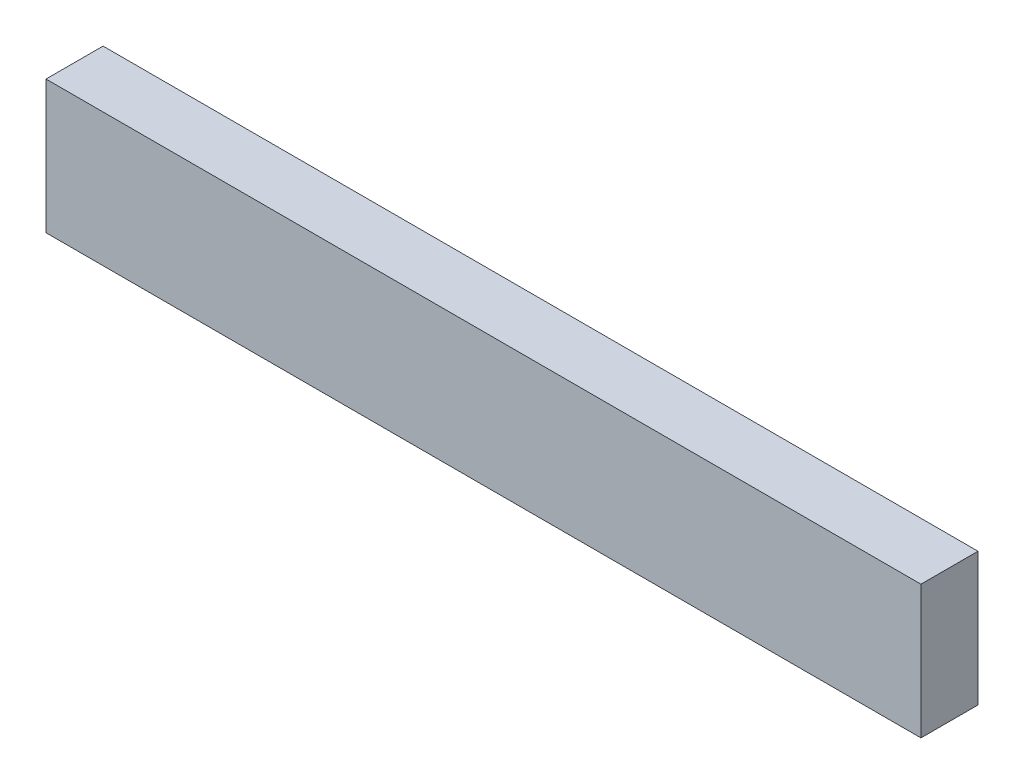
ISO-10303-21;
HEADER;
FILE_DESCRIPTION(('STEP AP214'),'2;1');
FILE_NAME('part.step','',(''),(''),'','','');
FILE_SCHEMA(('AUTOMOTIVE_DESIGN { 1 0 10303 214 1 1 1 1 }'));
ENDSEC;
DATA;
#1=APPLICATION_CONTEXT('core data for automotive mechanical design processes');
#2=APPLICATION_PROTOCOL_DEFINITION('international standard','automotive_design',2000,#1);
#3=PRODUCT_CONTEXT('',#1,'mechanical');
#4=PRODUCT('Part','Part','',(#3));
#5=PRODUCT_RELATED_PRODUCT_CATEGORY('part','',(#4));
#6=PRODUCT_DEFINITION_FORMATION('','',#4);
#7=PRODUCT_DEFINITION_CONTEXT('part definition',#1,'design');
#8=PRODUCT_DEFINITION('design','',#6,#7);
#9=PRODUCT_DEFINITION_SHAPE('','',#8);
#10=(LENGTH_UNIT() NAMED_UNIT(*) SI_UNIT(.MILLI.,.METRE.));
#11=(NAMED_UNIT(*) PLANE_ANGLE_UNIT() SI_UNIT($,.RADIAN.));
#12=(NAMED_UNIT(*) SI_UNIT($,.STERADIAN.) SOLID_ANGLE_UNIT());
#13=UNCERTAINTY_MEASURE_WITH_UNIT(LENGTH_MEASURE(1.E-05),#10,'distance_accuracy_value','');
#14=(GEOMETRIC_REPRESENTATION_CONTEXT(3) GLOBAL_UNCERTAINTY_ASSIGNED_CONTEXT((#13)) GLOBAL_UNIT_ASSIGNED_CONTEXT((#10,
#11,#12)) REPRESENTATION_CONTEXT('',''));
#15=CARTESIAN_POINT('',(0.,0.,0.));
#16=DIRECTION('',(0.,0.,1.));
#17=DIRECTION('',(1.,0.,0.));
#18=AXIS2_PLACEMENT_3D('',#15,#16,#17);
#19=CARTESIAN_POINT('',(584.2,-44.45,-19.05));
#20=DIRECTION('',(0.,0.,1.));
#21=DIRECTION('',(1.,0.,0.));
#22=AXIS2_PLACEMENT_3D('',#19,#20,#21);
#23=PLANE('',#22);
#24=DIRECTION('',(0.,1.,0.));
#25=VECTOR('',#24,1.);
#26=CARTESIAN_POINT('',(0.,-44.45,-19.05));
#27=LINE('',#26,#25);
#28=CARTESIAN_POINT('',(0.,-44.45,-19.05));
#29=VERTEX_POINT('',#28);
#30=CARTESIAN_POINT('',(0.,44.45,-19.05));
#31=VERTEX_POINT('',#30);
#32=EDGE_CURVE('E105',#29,#31,#27,.T.);
#33=ORIENTED_EDGE('',*,*,#32,.T.);
#34=DIRECTION('',(-1.,0.,0.));
#35=VECTOR('',#34,1.);
#36=CARTESIAN_POINT('',(584.2,44.45,-19.05));
#37=LINE('',#36,#35);
#38=CARTESIAN_POINT('',(584.2,44.45,-19.05));
#39=VERTEX_POINT('',#38);
#40=EDGE_CURVE('E11',#39,#31,#37,.T.);
#41=ORIENTED_EDGE('',*,*,#40,.F.);
#42=DIRECTION('',(0.,1.,0.));
#43=VECTOR('',#42,1.);
#44=CARTESIAN_POINT('',(584.2,-44.45,-19.05));
#45=LINE('',#44,#43);
#46=CARTESIAN_POINT('',(584.2,-44.45,-19.05));
#47=VERTEX_POINT('',#46);
#48=EDGE_CURVE('E88',#47,#39,#45,.T.);
#49=ORIENTED_EDGE('',*,*,#48,.F.);
#50=DIRECTION('',(-1.,0.,0.));
#51=VECTOR('',#50,1.);
#52=CARTESIAN_POINT('',(584.2,-44.45,-19.05));
#53=LINE('',#52,#51);
#54=EDGE_CURVE('E101',#47,#29,#53,.T.);
#55=ORIENTED_EDGE('',*,*,#54,.T.);
#56=EDGE_LOOP('',(#33,#41,#49,#55));
#57=FACE_BOUND('',#56,.T.);
#58=ADVANCED_FACE('F36',(#57),#23,.F.);
#59=CARTESIAN_POINT('',(584.2,44.45,19.05));
#60=DIRECTION('',(0.,-1.,0.));
#61=DIRECTION('',(0.,0.,-1.));
#62=AXIS2_PLACEMENT_3D('',#59,#60,#61);
#63=PLANE('',#62);
#64=DIRECTION('',(0.,0.,1.));
#65=VECTOR('',#64,1.);
#66=CARTESIAN_POINT('',(0.,44.45,19.05));
#67=LINE('',#66,#65);
#68=CARTESIAN_POINT('',(0.,44.45,19.05));
#69=VERTEX_POINT('',#68);
#70=EDGE_CURVE('E93',#31,#69,#67,.T.);
#71=ORIENTED_EDGE('',*,*,#70,.T.);
#72=DIRECTION('',(-1.,0.,0.));
#73=VECTOR('',#72,1.);
#74=CARTESIAN_POINT('',(584.2,44.45,19.05));
#75=LINE('',#74,#73);
#76=CARTESIAN_POINT('',(584.2,44.45,19.05));
#77=VERTEX_POINT('',#76);
#78=EDGE_CURVE('E45',#77,#69,#75,.T.);
#79=ORIENTED_EDGE('',*,*,#78,.F.);
#80=DIRECTION('',(0.,0.,1.));
#81=VECTOR('',#80,1.);
#82=CARTESIAN_POINT('',(584.2,44.45,19.05));
#83=LINE('',#82,#81);
#84=EDGE_CURVE('E83',#39,#77,#83,.T.);
#85=ORIENTED_EDGE('',*,*,#84,.F.);
#86=ORIENTED_EDGE('',*,*,#40,.T.);
#87=EDGE_LOOP('',(#71,#79,#85,#86));
#88=FACE_BOUND('',#87,.T.);
#89=ADVANCED_FACE('F92',(#88),#63,.F.);
#90=CARTESIAN_POINT('',(584.2,-44.45,19.05));
#91=DIRECTION('',(0.,0.,-1.));
#92=DIRECTION('',(-1.,0.,0.));
#93=AXIS2_PLACEMENT_3D('',#90,#91,#92);
#94=PLANE('',#93);
#95=DIRECTION('',(0.,-1.,0.));
#96=VECTOR('',#95,1.);
#97=CARTESIAN_POINT('',(0.,-44.45,19.05));
#98=LINE('',#97,#96);
#99=CARTESIAN_POINT('',(0.,-44.45,19.05));
#100=VERTEX_POINT('',#99);
#101=EDGE_CURVE('E70',#69,#100,#98,.T.);
#102=ORIENTED_EDGE('',*,*,#101,.T.);
#103=DIRECTION('',(-1.,0.,0.));
#104=VECTOR('',#103,1.);
#105=CARTESIAN_POINT('',(584.2,-44.45,19.05));
#106=LINE('',#105,#104);
#107=CARTESIAN_POINT('',(584.2,-44.45,19.05));
#108=VERTEX_POINT('',#107);
#109=EDGE_CURVE('E95',#108,#100,#106,.T.);
#110=ORIENTED_EDGE('',*,*,#109,.F.);
#111=DIRECTION('',(0.,-1.,0.));
#112=VECTOR('',#111,1.);
#113=CARTESIAN_POINT('',(584.2,-44.45,19.05));
#114=LINE('',#113,#112);
#115=EDGE_CURVE('E86',#77,#108,#114,.T.);
#116=ORIENTED_EDGE('',*,*,#115,.F.);
#117=ORIENTED_EDGE('',*,*,#78,.T.);
#118=EDGE_LOOP('',(#102,#110,#116,#117));
#119=FACE_BOUND('',#118,.T.);
#120=ADVANCED_FACE('F96',(#119),#94,.F.);
#121=CARTESIAN_POINT('',(584.2,-44.45,19.05));
#122=DIRECTION('',(0.,1.,0.));
#123=DIRECTION('',(0.,0.,1.));
#124=AXIS2_PLACEMENT_3D('',#121,#122,#123);
#125=PLANE('',#124);
#126=DIRECTION('',(0.,0.,-1.));
#127=VECTOR('',#126,1.);
#128=CARTESIAN_POINT('',(0.,-44.45,19.05));
#129=LINE('',#128,#127);
#130=EDGE_CURVE('E76',#100,#29,#129,.T.);
#131=ORIENTED_EDGE('',*,*,#130,.T.);
#132=ORIENTED_EDGE('',*,*,#54,.F.);
#133=DIRECTION('',(0.,0.,-1.));
#134=VECTOR('',#133,1.);
#135=CARTESIAN_POINT('',(584.2,-44.45,19.05));
#136=LINE('',#135,#134);
#137=EDGE_CURVE('E53',#108,#47,#136,.T.);
#138=ORIENTED_EDGE('',*,*,#137,.F.);
#139=ORIENTED_EDGE('',*,*,#109,.T.);
#140=EDGE_LOOP('',(#131,#132,#138,#139));
#141=FACE_BOUND('',#140,.T.);
#142=ADVANCED_FACE('F119',(#141),#125,.F.);
#143=CARTESIAN_POINT('',(584.2,0.,0.));
#144=DIRECTION('',(-1.,0.,0.));
#145=DIRECTION('',(0.,0.,1.));
#146=AXIS2_PLACEMENT_3D('',#143,#144,#145);
#147=PLANE('',#146);
#148=ORIENTED_EDGE('',*,*,#48,.T.);
#149=ORIENTED_EDGE('',*,*,#84,.T.);
#150=ORIENTED_EDGE('',*,*,#115,.T.);
#151=ORIENTED_EDGE('',*,*,#137,.T.);
#152=EDGE_LOOP('',(#148,#149,#150,#151));
#153=FACE_BOUND('',#152,.T.);
#154=ADVANCED_FACE('F84',(#153),#147,.F.);
#155=CARTESIAN_POINT('',(0.,0.,0.));
#156=DIRECTION('',(-1.,0.,0.));
#157=DIRECTION('',(0.,0.,1.));
#158=AXIS2_PLACEMENT_3D('',#155,#156,#157);
#159=PLANE('',#158);
#160=ORIENTED_EDGE('',*,*,#32,.F.);
#161=ORIENTED_EDGE('',*,*,#130,.F.);
#162=ORIENTED_EDGE('',*,*,#101,.F.);
#163=ORIENTED_EDGE('',*,*,#70,.F.);
#164=EDGE_LOOP('',(#160,#161,#162,#163));
#165=FACE_BOUND('',#164,.T.);
#166=ADVANCED_FACE('F122',(#165),#159,.T.);
#167=CLOSED_SHELL('',(#58,#89,#120,#142,#154,#166));
#168=MANIFOLD_SOLID_BREP('B2',#167);
#169=ADVANCED_BREP_SHAPE_REPRESENTATION('',(#18,#168),#14);
#170=SHAPE_DEFINITION_REPRESENTATION(#9,#169);
ENDSEC;
END-ISO-10303-21;
